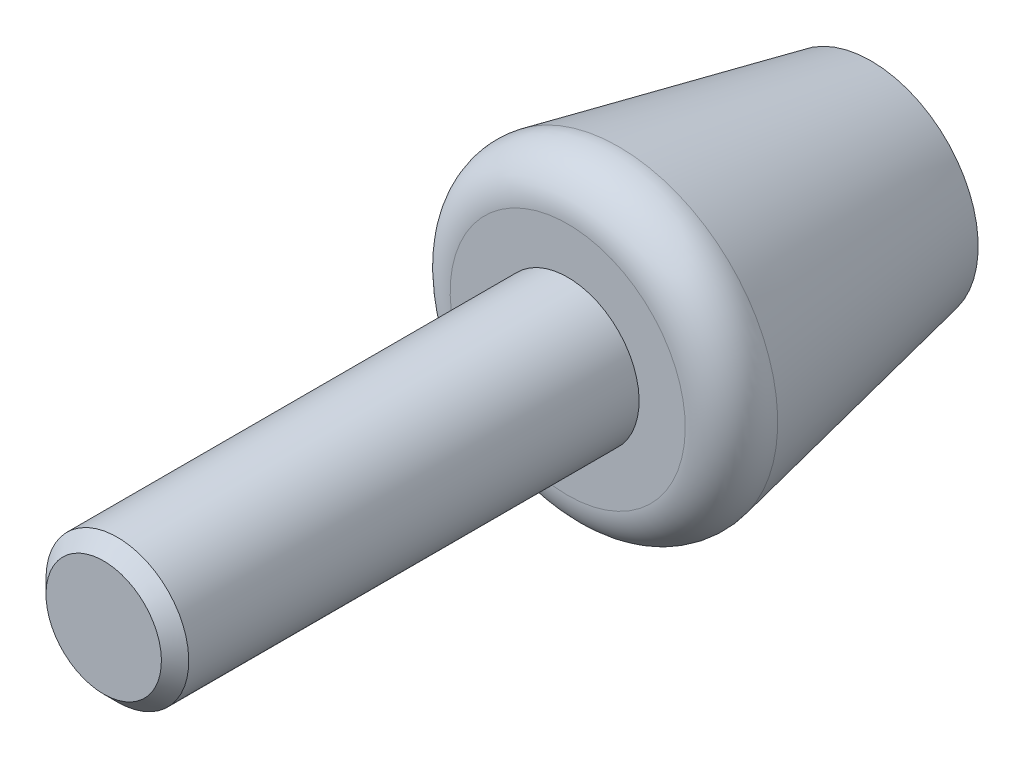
ISO-10303-21;
HEADER;
FILE_DESCRIPTION(('STEP AP214'),'2;1');
FILE_NAME('part.step','',(''),(''),'','','');
FILE_SCHEMA(('AUTOMOTIVE_DESIGN { 1 0 10303 214 1 1 1 1 }'));
ENDSEC;
DATA;
#1=APPLICATION_CONTEXT('core data for automotive mechanical design processes');
#2=APPLICATION_PROTOCOL_DEFINITION('international standard','automotive_design',2000,#1);
#3=PRODUCT_CONTEXT('',#1,'mechanical');
#4=PRODUCT('Part','Part','',(#3));
#5=PRODUCT_RELATED_PRODUCT_CATEGORY('part','',(#4));
#6=PRODUCT_DEFINITION_FORMATION('','',#4);
#7=PRODUCT_DEFINITION_CONTEXT('part definition',#1,'design');
#8=PRODUCT_DEFINITION('design','',#6,#7);
#9=PRODUCT_DEFINITION_SHAPE('','',#8);
#10=(LENGTH_UNIT() NAMED_UNIT(*) SI_UNIT(.MILLI.,.METRE.));
#11=(NAMED_UNIT(*) PLANE_ANGLE_UNIT() SI_UNIT($,.RADIAN.));
#12=(NAMED_UNIT(*) SI_UNIT($,.STERADIAN.) SOLID_ANGLE_UNIT());
#13=UNCERTAINTY_MEASURE_WITH_UNIT(LENGTH_MEASURE(1.E-05),#10,'distance_accuracy_value','');
#14=(GEOMETRIC_REPRESENTATION_CONTEXT(3) GLOBAL_UNCERTAINTY_ASSIGNED_CONTEXT((#13)) GLOBAL_UNIT_ASSIGNED_CONTEXT((#10,
#11,#12)) REPRESENTATION_CONTEXT('',''));
#15=CARTESIAN_POINT('',(0.,0.,0.));
#16=DIRECTION('',(0.,0.,1.));
#17=DIRECTION('',(1.,0.,0.));
#18=AXIS2_PLACEMENT_3D('',#15,#16,#17);
#19=CARTESIAN_POINT('',(0.,0.,43.));
#20=DIRECTION('',(0.,0.,1.));
#21=DIRECTION('',(0.,-1.,0.));
#22=AXIS2_PLACEMENT_3D('',#19,#20,#21);
#23=PLANE('',#22);
#24=CARTESIAN_POINT('',(0.,0.,43.));
#25=DIRECTION('',(0.,0.,1.));
#26=DIRECTION('',(0.,-1.,0.));
#27=AXIS2_PLACEMENT_3D('',#24,#25,#26);
#28=CIRCLE('',#27,3.233);
#29=CARTESIAN_POINT('',(0.,-3.233,43.));
#30=VERTEX_POINT('',#29);
#31=EDGE_CURVE('E8',#30,#30,#28,.T.);
#32=ORIENTED_EDGE('',*,*,#31,.T.);
#33=EDGE_LOOP('',(#32));
#34=FACE_BOUND('',#33,.T.);
#35=ADVANCED_FACE('F13',(#34),#23,.T.);
#36=CARTESIAN_POINT('',(0.,0.,43.));
#37=DIRECTION('',(0.,0.,-1.));
#38=DIRECTION('',(0.,1.,0.));
#39=AXIS2_PLACEMENT_3D('',#36,#37,#38);
#40=CONICAL_SURFACE('',#39,3.233,0.78539816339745);
#41=CARTESIAN_POINT('',(0.,0.,42.233));
#42=DIRECTION('',(0.,0.,1.));
#43=DIRECTION('',(0.,-1.,0.));
#44=AXIS2_PLACEMENT_3D('',#41,#42,#43);
#45=CIRCLE('',#44,4.);
#46=CARTESIAN_POINT('',(0.,-4.,42.233));
#47=VERTEX_POINT('',#46);
#48=EDGE_CURVE('E19',#47,#47,#45,.T.);
#49=ORIENTED_EDGE('',*,*,#48,.T.);
#50=EDGE_LOOP('',(#49));
#51=FACE_BOUND('',#50,.T.);
#52=ORIENTED_EDGE('',*,*,#31,.F.);
#53=EDGE_LOOP('',(#52));
#54=FACE_BOUND('',#53,.T.);
#55=ADVANCED_FACE('F53',(#51,#54),#40,.T.);
#56=CARTESIAN_POINT('',(0.,0.,0.));
#57=DIRECTION('',(0.,0.,1.));
#58=DIRECTION('',(0.,-1.,0.));
#59=AXIS2_PLACEMENT_3D('',#56,#57,#58);
#60=CYLINDRICAL_SURFACE('',#59,4.);
#61=CARTESIAN_POINT('',(0.,0.,17.));
#62=DIRECTION('',(0.,0.,1.));
#63=DIRECTION('',(0.,-1.,0.));
#64=AXIS2_PLACEMENT_3D('',#61,#62,#63);
#65=CIRCLE('',#64,4.);
#66=CARTESIAN_POINT('',(0.,-4.,17.));
#67=VERTEX_POINT('',#66);
#68=EDGE_CURVE('E23',#67,#67,#65,.T.);
#69=ORIENTED_EDGE('',*,*,#68,.T.);
#70=EDGE_LOOP('',(#69));
#71=FACE_BOUND('',#70,.T.);
#72=ORIENTED_EDGE('',*,*,#48,.F.);
#73=EDGE_LOOP('',(#72));
#74=FACE_BOUND('',#73,.T.);
#75=ADVANCED_FACE('F58',(#71,#74),#60,.T.);
#76=CARTESIAN_POINT('',(4.,0.,17.));
#77=DIRECTION('',(0.,0.,1.));
#78=DIRECTION('',(0.,-1.,0.));
#79=AXIS2_PLACEMENT_3D('',#76,#77,#78);
#80=PLANE('',#79);
#81=CARTESIAN_POINT('',(0.,0.,17.));
#82=DIRECTION('',(0.,0.,1.));
#83=DIRECTION('',(0.,-1.,0.));
#84=AXIS2_PLACEMENT_3D('',#81,#82,#83);
#85=CIRCLE('',#84,6.5862165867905);
#86=CARTESIAN_POINT('',(0.,-6.5862165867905,17.));
#87=VERTEX_POINT('',#86);
#88=EDGE_CURVE('E27',#87,#87,#85,.T.);
#89=ORIENTED_EDGE('',*,*,#88,.T.);
#90=EDGE_LOOP('',(#89));
#91=FACE_BOUND('',#90,.T.);
#92=ORIENTED_EDGE('',*,*,#68,.F.);
#93=EDGE_LOOP('',(#92));
#94=FACE_BOUND('',#93,.T.);
#95=ADVANCED_FACE('F63',(#91,#94),#80,.T.);
#96=CARTESIAN_POINT('',(0.,0.,14.625));
#97=DIRECTION('',(0.,0.,1.));
#98=DIRECTION('',(0.,-1.,0.));
#99=AXIS2_PLACEMENT_3D('',#96,#97,#98);
#100=TOROIDAL_SURFACE('',#99,6.58621658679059,2.37499999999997);
#101=CARTESIAN_POINT('',(0.,0.,14.1460743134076));
#102=DIRECTION('',(0.,0.,1.));
#103=DIRECTION('',(0.,-1.,0.));
#104=AXIS2_PLACEMENT_3D('',#101,#102,#103);
#105=CIRCLE('',#104,8.9124270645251);
#106=CARTESIAN_POINT('',(0.,-8.9124270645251,14.1460743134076));
#107=VERTEX_POINT('',#106);
#108=EDGE_CURVE('E32',#107,#107,#105,.T.);
#109=ORIENTED_EDGE('',*,*,#108,.T.);
#110=EDGE_LOOP('',(#109));
#111=FACE_BOUND('',#110,.T.);
#112=ORIENTED_EDGE('',*,*,#88,.F.);
#113=EDGE_LOOP('',(#112));
#114=FACE_BOUND('',#113,.T.);
#115=ADVANCED_FACE('F50',(#111,#114),#100,.T.);
#116=CARTESIAN_POINT('',(0.,0.,14.1460743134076));
#117=DIRECTION('',(0.,0.,1.));
#118=DIRECTION('',(0.,-1.,0.));
#119=AXIS2_PLACEMENT_3D('',#116,#117,#118);
#120=CONICAL_SURFACE('',#119,8.9124270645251,0.203045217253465);
#121=CARTESIAN_POINT('',(0.,0.,0.));
#122=DIRECTION('',(0.,0.,1.));
#123=DIRECTION('',(0.,-1.,0.));
#124=AXIS2_PLACEMENT_3D('',#121,#122,#123);
#125=CIRCLE('',#124,6.);
#126=CARTESIAN_POINT('',(0.,-6.,0.));
#127=VERTEX_POINT('',#126);
#128=EDGE_CURVE('E35',#127,#127,#125,.T.);
#129=ORIENTED_EDGE('',*,*,#128,.T.);
#130=EDGE_LOOP('',(#129));
#131=FACE_BOUND('',#130,.T.);
#132=ORIENTED_EDGE('',*,*,#108,.F.);
#133=EDGE_LOOP('',(#132));
#134=FACE_BOUND('',#133,.T.);
#135=ADVANCED_FACE('F39',(#131,#134),#120,.T.);
#136=CARTESIAN_POINT('',(6.,0.,0.));
#137=DIRECTION('',(0.,0.,-1.));
#138=DIRECTION('',(0.,1.,0.));
#139=AXIS2_PLACEMENT_3D('',#136,#137,#138);
#140=PLANE('',#139);
#141=ORIENTED_EDGE('',*,*,#128,.F.);
#142=EDGE_LOOP('',(#141));
#143=FACE_BOUND('',#142,.T.);
#144=ADVANCED_FACE('F42',(#143),#140,.T.);
#145=CLOSED_SHELL('',(#35,#55,#75,#95,#115,#135,#144));
#146=MANIFOLD_SOLID_BREP('B1',#145);
#147=ADVANCED_BREP_SHAPE_REPRESENTATION('',(#18,#146),#14);
#148=SHAPE_DEFINITION_REPRESENTATION(#9,#147);
ENDSEC;
END-ISO-10303-21;
